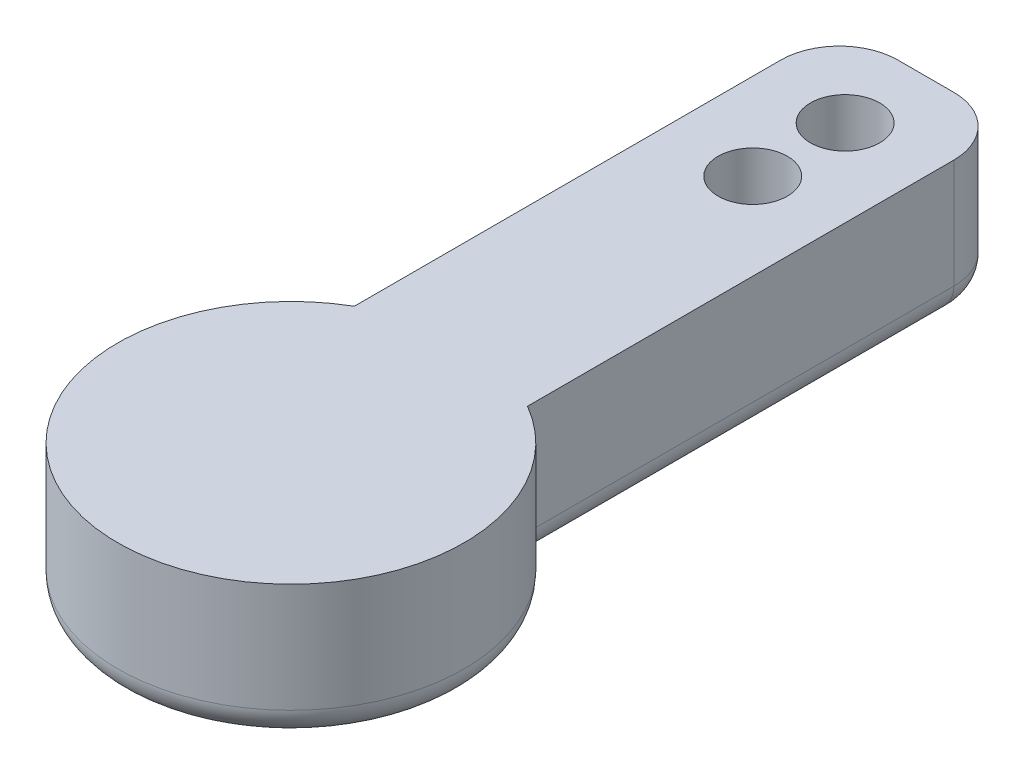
from build123d import *

# Parameters (mm, degrees)
SKETCH1_W           = 7.5
SKETCH1_H           = 20
SKETCH1_R           = 7.5
BOSS_EXTRUDE1_DEPTH = 6
SKETCH2_R           = 3
SKETCH2_R_2         = 1.5
CUT_EXTRUDE1_DEPTH  = 30.129023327
BOSS_EXTRUDE2_START = -1
SKETCH3_R           = 3
BOSS_EXTRUDE2_DEPTH = 1
FILLET1_R           = 2.54
FILLET4_R           = 1.27


with BuildPart() as part:
    # Sketch1 → Boss-Extrude1 (new body)
    with BuildSketch(Plane(origin=(0, 0, 0), x_dir=(1, 0, 0), z_dir=(0, 1, 0))):
        with Locations((0, 17.5)):
            Rectangle(SKETCH1_W, SKETCH1_H)
        with BuildLine():
            Line((3.75, 7.5), (0, 7.5))
            ThreePointArc((0, 7.5), (1.941142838, 7.244443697), (3.75, 6.495190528))
            Line((3.75, 6.495190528), (3.75, 7.5))
        make_face()
        with BuildLine():
            Line((0, 7.5), (-3.75, 7.5))
            Line((-3.75, 7.5), (-3.75, 6.495190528))
            ThreePointArc((-3.75, 6.495190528), (-1.941142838, 7.244443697), (0, 7.5))
        make_face()
        Circle(SKETCH1_R)
    extrude(amount=BOSS_EXTRUDE1_DEPTH)

    # Sketch2 → Cut-Extrude1 (cut, through all)
    with BuildSketch(Plane.XZ):
        with Locations(Location((0, 0, 0), (0, 0, 270))):
            Circle(SKETCH2_R)
        with Locations(Location((0, -20, 0), (0, 0, 270))):
            Circle(SKETCH2_R_2)
        with Locations(Location((0, -24, 0), (0, 0, 270))):
            Circle(SKETCH2_R_2)
    extrude(amount=-CUT_EXTRUDE1_DEPTH, mode=Mode.SUBTRACT)

    # Sketch3 → Boss-Extrude2 (add)
    with BuildSketch(Plane(origin=(0, 6, 0), x_dir=(1, 0, 0), z_dir=(0, 1, 0)).offset(BOSS_EXTRUDE2_START)):
        with Locations(Location((0, 0, 0), (0, 0, 90))):
            Circle(SKETCH3_R)
    extrude(amount=BOSS_EXTRUDE2_DEPTH)

    # Fillet1
    fillet1_edges = [part.edges().sort_by_distance(p)[0] for p in [
        (3.75, 3, -27.5),
        (-3.75, 3, -27.5),
    ]]
    fillet(fillet1_edges, radius=FILLET1_R)

    # Fillet4
    fillet4_edges = [part.edges().sort_by_distance(p)[0] for p in [
        (-3.75, 0, -15.727595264),
        (3.75, 0, -15.727595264),
        (0, 0, -27.5),
        (3.006051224, 0, -26.756051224),
        (-3.006051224, 0, -26.756051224),
        (0, 0, 7.5),
    ]]
    fillet(fillet4_edges, radius=FILLET4_R)


solid = part.part
